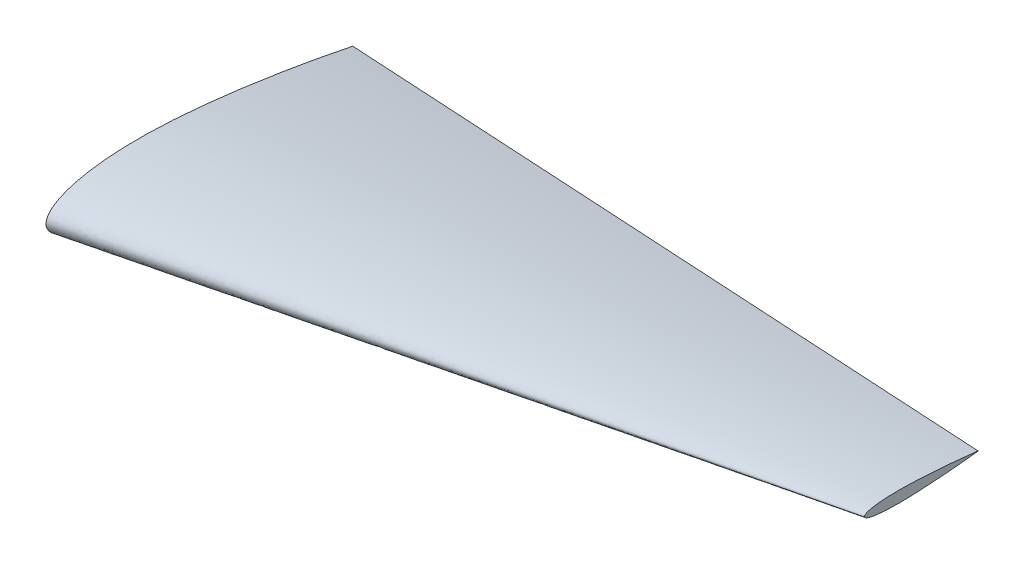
ISO-10303-21;
HEADER;
FILE_DESCRIPTION(('STEP AP214'),'2;1');
FILE_NAME('part.step','',(''),(''),'','','');
FILE_SCHEMA(('AUTOMOTIVE_DESIGN { 1 0 10303 214 1 1 1 1 }'));
ENDSEC;
DATA;
#1=APPLICATION_CONTEXT('core data for automotive mechanical design processes');
#2=APPLICATION_PROTOCOL_DEFINITION('international standard','automotive_design',2000,#1);
#3=PRODUCT_CONTEXT('',#1,'mechanical');
#4=PRODUCT('Part','Part','',(#3));
#5=PRODUCT_RELATED_PRODUCT_CATEGORY('part','',(#4));
#6=PRODUCT_DEFINITION_FORMATION('','',#4);
#7=PRODUCT_DEFINITION_CONTEXT('part definition',#1,'design');
#8=PRODUCT_DEFINITION('design','',#6,#7);
#9=PRODUCT_DEFINITION_SHAPE('','',#8);
#10=(LENGTH_UNIT() NAMED_UNIT(*) SI_UNIT(.MILLI.,.METRE.));
#11=(NAMED_UNIT(*) PLANE_ANGLE_UNIT() SI_UNIT($,.RADIAN.));
#12=(NAMED_UNIT(*) SI_UNIT($,.STERADIAN.) SOLID_ANGLE_UNIT());
#13=UNCERTAINTY_MEASURE_WITH_UNIT(LENGTH_MEASURE(1.E-05),#10,'distance_accuracy_value','');
#14=(GEOMETRIC_REPRESENTATION_CONTEXT(3) GLOBAL_UNCERTAINTY_ASSIGNED_CONTEXT((#13)) GLOBAL_UNIT_ASSIGNED_CONTEXT((#10,
#11,#12)) REPRESENTATION_CONTEXT('',''));
#15=CARTESIAN_POINT('',(0.,0.,0.));
#16=DIRECTION('',(0.,0.,1.));
#17=DIRECTION('',(1.,0.,0.));
#18=AXIS2_PLACEMENT_3D('',#15,#16,#17);
#19=CARTESIAN_POINT('',(14935.2,812.8,-2222.5));
#20=DIRECTION('',(-1.,0.,0.));
#21=DIRECTION('',(0.,0.,1.));
#22=AXIS2_PLACEMENT_3D('',#19,#20,#21);
#23=PLANE('',#22);
#24=CARTESIAN_POINT('',(14935.2,815.12029,-4432.3));
#25=CARTESIAN_POINT('',(14935.2,819.346363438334,-4395.47551523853));
#26=CARTESIAN_POINT('',(14935.2,827.795566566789,-4321.85219647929));
#27=CARTESIAN_POINT('',(14935.2,843.49566483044,-4174.56617552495));
#28=CARTESIAN_POINT('',(14935.2,861.540377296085,-3990.45543112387));
#29=CARTESIAN_POINT('',(14935.2,880.663705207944,-3769.46147230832));
#30=CARTESIAN_POINT('',(14935.2,897.345117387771,-3548.48591496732));
#31=CARTESIAN_POINT('',(14935.2,910.944822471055,-3327.50505017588));
#32=CARTESIAN_POINT('',(14935.2,920.621295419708,-3106.50973377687));
#33=CARTESIAN_POINT('',(14935.2,924.006009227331,-2922.27957229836));
#34=CARTESIAN_POINT('',(14935.2,922.66713878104,-2774.92190053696));
#35=CARTESIAN_POINT('',(14935.2,919.031186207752,-2664.37871481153));
#36=CARTESIAN_POINT('',(14935.2,912.014732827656,-2553.75681745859));
#37=CARTESIAN_POINT('',(14935.2,902.241566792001,-2461.64264259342));
#38=CARTESIAN_POINT('',(14935.2,890.524937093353,-2387.92899027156));
#39=CARTESIAN_POINT('',(14935.2,879.083851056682,-2332.52610242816));
#40=CARTESIAN_POINT('',(14935.2,864.547458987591,-2285.42062808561));
#41=CARTESIAN_POINT('',(14935.2,848.102286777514,-2246.35424727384));
#42=CARTESIAN_POINT('',(14935.2,812.8,-2208.37468663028));
#43=CARTESIAN_POINT('',(14935.2,777.497713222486,-2246.35424727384));
#44=CARTESIAN_POINT('',(14935.2,761.052541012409,-2285.42062808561));
#45=CARTESIAN_POINT('',(14935.2,746.516148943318,-2332.52610242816));
#46=CARTESIAN_POINT('',(14935.2,735.075062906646,-2387.92899027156));
#47=CARTESIAN_POINT('',(14935.2,723.358433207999,-2461.64264259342));
#48=CARTESIAN_POINT('',(14935.2,713.585267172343,-2553.75681745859));
#49=CARTESIAN_POINT('',(14935.2,706.568813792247,-2664.37871481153));
#50=CARTESIAN_POINT('',(14935.2,702.932861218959,-2774.92190053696));
#51=CARTESIAN_POINT('',(14935.2,701.593990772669,-2922.27957229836));
#52=CARTESIAN_POINT('',(14935.2,704.978704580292,-3106.50973377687));
#53=CARTESIAN_POINT('',(14935.2,714.655177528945,-3327.50505017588));
#54=CARTESIAN_POINT('',(14935.2,728.254882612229,-3548.48591496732));
#55=CARTESIAN_POINT('',(14935.2,744.936294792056,-3769.46147230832));
#56=CARTESIAN_POINT('',(14935.2,764.059622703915,-3990.45543112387));
#57=CARTESIAN_POINT('',(14935.2,782.104335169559,-4174.56617552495));
#58=CARTESIAN_POINT('',(14935.2,797.804433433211,-4321.85219647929));
#59=CARTESIAN_POINT('',(14935.2,806.253636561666,-4395.47551523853));
#60=CARTESIAN_POINT('',(14935.2,810.47971,-4432.3));
#61=B_SPLINE_CURVE_WITH_KNOTS('',3,(#24,#25,#26,#27,#28,#29,#30,#31,#32,#33,#34,#35,#36,#37,#38,
#39,#40,#41,#42,#43,#44,#45,#46,#47,#48,#49,#50,#51,#52,#53,#54,#55,#56,#57,#58,#59,#60),
.UNSPECIFIED.,.F.,.F.,(4,1,1,1,1,1,1,1,1,1,1,1,1,1,1,1,1,1,1,1,1,1,1,1,1,1,1,1,1,1,1,1,1,1,4),
(0.,0.0248235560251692,0.0496298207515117,0.0991970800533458,0.148712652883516,
0.198182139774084,0.247604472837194,0.296979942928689,0.34631759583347,0.370984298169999,
0.395664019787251,0.420382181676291,0.445198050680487,0.457689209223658,0.470304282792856,
0.483229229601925,0.4900691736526,0.5,0.5099308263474,0.516770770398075,0.529695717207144,
0.542310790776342,0.554801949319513,0.579617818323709,0.604335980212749,0.629015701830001,
0.65368240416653,0.703020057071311,0.752395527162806,0.801817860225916,0.851287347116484,
0.900802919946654,0.950370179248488,0.975176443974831,1.),.UNSPECIFIED.);
#62=CARTESIAN_POINT('',(14935.2,815.12029,-4432.3));
#63=VERTEX_POINT('',#62);
#64=CARTESIAN_POINT('',(14935.2,810.47971,-4432.3));
#65=VERTEX_POINT('',#64);
#66=EDGE_CURVE('E58',#63,#65,#61,.T.);
#67=ORIENTED_EDGE('',*,*,#66,.T.);
#68=DIRECTION('',(0.,1.,0.));
#69=VECTOR('',#68,1.);
#70=CARTESIAN_POINT('',(14935.2,815.12029,-4432.3));
#71=LINE('',#70,#69);
#72=EDGE_CURVE('E12',#65,#63,#71,.T.);
#73=ORIENTED_EDGE('',*,*,#72,.T.);
#74=EDGE_LOOP('',(#67,#73));
#75=FACE_BOUND('',#74,.T.);
#76=ADVANCED_FACE('F48',(#75),#23,.F.);
#77=CARTESIAN_POINT('',(1219.2,5.75685332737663E-10,1.09287578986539E-12));
#78=DIRECTION('',(-1.,0.,0.));
#79=DIRECTION('',(0.,0.,1.));
#80=AXIS2_PLACEMENT_3D('',#77,#78,#79);
#81=PLANE('',#80);
#82=CARTESIAN_POINT('',(1219.2,11.2910112,-5974.08));
#83=CARTESIAN_POINT('',(1219.2,31.8647324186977,-5874.56046449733));
#84=CARTESIAN_POINT('',(1219.2,72.9659085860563,-5675.74519343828));
#85=CARTESIAN_POINT('',(1219.2,149.222472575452,-5277.7494338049));
#86=CARTESIAN_POINT('',(1219.2,236.912546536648,-4780.23705300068));
#87=CARTESIAN_POINT('',(1219.2,330.257228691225,-4182.7518974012));
#88=CARTESIAN_POINT('',(1219.2,411.272923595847,-3585.35903312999));
#89=CARTESIAN_POINT('',(1219.2,477.533140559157,-2987.95799615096));
#90=CARTESIAN_POINT('',(1219.2,524.494664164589,-2390.41312173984));
#91=CARTESIAN_POINT('',(1219.2,541.175696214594,-1891.87330758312));
#92=CARTESIAN_POINT('',(1219.2,534.518135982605,-1493.27902018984));
#93=CARTESIAN_POINT('',(1219.2,516.801572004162,-1194.09128821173));
#94=CARTESIAN_POINT('',(1219.2,482.596469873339,-894.341071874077));
#95=CARTESIAN_POINT('',(1219.2,434.79814055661,-644.860533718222));
#96=CARTESIAN_POINT('',(1219.2,377.949357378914,-445.877300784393));
#97=CARTESIAN_POINT('',(1219.2,320.514983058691,-293.922685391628));
#98=CARTESIAN_POINT('',(1219.2,251.352347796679,-166.644400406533));
#99=CARTESIAN_POINT('',(1219.2,155.691980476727,-49.5670990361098));
#100=CARTESIAN_POINT('',(1219.2,5.78634039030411E-10,32.3453004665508));
#101=CARTESIAN_POINT('',(1219.2,-155.691980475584,-49.5670990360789));
#102=CARTESIAN_POINT('',(1219.2,-251.352347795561,-166.644400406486));
#103=CARTESIAN_POINT('',(1219.2,-320.514983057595,-293.922685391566));
#104=CARTESIAN_POINT('',(1219.2,-377.949357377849,-445.877300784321));
#105=CARTESIAN_POINT('',(1219.2,-434.798140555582,-644.860533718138));
#106=CARTESIAN_POINT('',(1219.2,-482.59646987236,-894.341071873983));
#107=CARTESIAN_POINT('',(1219.2,-516.801572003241,-1194.09128821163));
#108=CARTESIAN_POINT('',(1219.2,-534.518135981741,-1493.27902018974));
#109=CARTESIAN_POINT('',(1219.2,-541.175696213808,-1891.87330758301));
#110=CARTESIAN_POINT('',(1219.2,-524.494664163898,-2390.41312173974));
#111=CARTESIAN_POINT('',(1219.2,-477.533140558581,-2987.95799615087));
#112=CARTESIAN_POINT('',(1219.2,-411.272923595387,-3585.35903312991));
#113=CARTESIAN_POINT('',(1219.2,-330.257228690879,-4182.75189740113));
#114=CARTESIAN_POINT('',(1219.2,-236.912546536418,-4780.23705300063));
#115=CARTESIAN_POINT('',(1219.2,-149.222472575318,-5277.74943380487));
#116=CARTESIAN_POINT('',(1219.2,-72.9659085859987,-5675.74519343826));
#117=CARTESIAN_POINT('',(1219.2,-31.8647324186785,-5874.56046449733));
#118=CARTESIAN_POINT('',(1219.2,-11.2910112,-5974.08));
#119=B_SPLINE_CURVE_WITH_KNOTS('',3,(#82,#83,#84,#85,#86,#87,#88,#89,#90,#91,#92,#93,#94,#95,
#96,#97,#98,#99,#100,#101,#102,#103,#104,#105,#106,#107,#108,#109,#110,#111,#112,#113,#114,#115,
#116,#117,#118),.UNSPECIFIED.,.F.,.F.,(4,1,1,1,1,1,1,1,1,1,1,1,1,1,1,1,1,1,1,1,1,1,1,1,1,1,1,1,
1,1,1,1,1,1,4),(0.,0.0246038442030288,0.0491523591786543,0.0981086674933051,0.146905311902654,
0.195554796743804,0.244056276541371,0.292409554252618,0.340643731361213,0.364754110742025,
0.388905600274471,0.413178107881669,0.437756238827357,0.450304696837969,0.463229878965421,
0.477067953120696,0.485035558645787,0.5,0.514964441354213,0.522932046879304,0.536770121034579,
0.549695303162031,0.562243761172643,0.586821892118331,0.611094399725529,0.635245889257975,
0.659356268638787,0.707590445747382,0.755943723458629,0.804445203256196,0.853094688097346,
0.901891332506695,0.950847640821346,0.975396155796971,1.),.UNSPECIFIED.);
#120=CARTESIAN_POINT('',(1219.2,11.2910112,-5974.08));
#121=VERTEX_POINT('',#120);
#122=CARTESIAN_POINT('',(1219.2,-11.2910112,-5974.08));
#123=VERTEX_POINT('',#122);
#124=EDGE_CURVE('E82',#121,#123,#119,.T.);
#125=ORIENTED_EDGE('',*,*,#124,.F.);
#126=DIRECTION('',(0.,1.,0.));
#127=VECTOR('',#126,1.);
#128=CARTESIAN_POINT('',(1219.2,11.2910112,-5974.08));
#129=LINE('',#128,#127);
#130=EDGE_CURVE('E86',#123,#121,#129,.T.);
#131=ORIENTED_EDGE('',*,*,#130,.F.);
#132=EDGE_LOOP('',(#125,#131));
#133=FACE_BOUND('',#132,.T.);
#134=ADVANCED_FACE('F95',(#133),#81,.T.);
#135=CARTESIAN_POINT('',(1219.2,11.2910112,-5974.08));
#136=CARTESIAN_POINT('',(14935.2,815.12029,-4432.3));
#137=CARTESIAN_POINT('',(1219.2,31.8647324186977,-5874.56046449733));
#138=CARTESIAN_POINT('',(14935.2,819.308958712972,-4395.80144656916));
#139=CARTESIAN_POINT('',(1219.2,52.6221765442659,-5774.15222159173));
#140=CARTESIAN_POINT('',(14935.2,823.535032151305,-4358.97696180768));
#141=CARTESIAN_POINT('',(1219.2,92.2604228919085,-5575.04389670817));
#142=CARTESIAN_POINT('',(14935.2,831.611209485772,-4286.02946135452));
#143=CARTESIAN_POINT('',(1219.2,111.707763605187,-5473.5206036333));
#144=CARTESIAN_POINT('',(14935.2,835.574997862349,-4248.87166721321));
#145=CARTESIAN_POINT('',(1219.2,167.166081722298,-5175.94580537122));
#146=CARTESIAN_POINT('',(14935.2,846.871435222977,-4140.02782867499));
#147=CARTESIAN_POINT('',(1219.2,203.028703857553,-4972.36474288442));
#148=CARTESIAN_POINT('',(14935.2,854.169798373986,-4065.65766970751));
#149=CARTESIAN_POINT('',(1219.2,268.820543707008,-4575.99880167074));
#150=CARTESIAN_POINT('',(14935.2,867.532840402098,-3921.02309607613));
#151=CARTESIAN_POINT('',(1219.2,301.038498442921,-4369.47129648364));
#152=CARTESIAN_POINT('',(14935.2,874.06277430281,-3845.74348029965));
#153=CARTESIAN_POINT('',(1219.2,358.347562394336,-3975.61962594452));
#154=CARTESIAN_POINT('',(14935.2,885.708701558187,-3702.33514700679));
#155=CARTESIAN_POINT('',(1219.2,386.716268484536,-3765.72132380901));
#156=CARTESIAN_POINT('',(14935.2,891.494586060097,-3625.98681278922));
#157=CARTESIAN_POINT('',(1219.2,434.623539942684,-3374.83025645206));
#158=CARTESIAN_POINT('',(14935.2,901.277604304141,-3483.95695874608));
#159=CARTESIAN_POINT('',(1219.2,458.140133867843,-3161.11038082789));
#160=CARTESIAN_POINT('',(14935.2,906.090439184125,-3406.38365895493));
#161=CARTESIAN_POINT('',(1219.2,494.380270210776,-2773.59280526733));
#162=CARTESIAN_POINT('',(14935.2,913.578217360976,-3265.88272453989));
#163=CARTESIAN_POINT('',(1219.2,511.149702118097,-2555.60476811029));
#164=CARTESIAN_POINT('',(14935.2,917.099925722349,-3186.9322404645));
#165=CARTESIAN_POINT('',(1219.2,531.808974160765,-2171.81305339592));
#166=CARTESIAN_POINT('',(14935.2,921.577394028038,-3048.07500902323));
#167=CARTESIAN_POINT('',(1219.2,538.553684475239,-1949.14635833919));
#168=CARTESIAN_POINT('',(14935.2,923.173667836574,-2967.58396065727));
#169=CARTESIAN_POINT('',(1219.2,537.456413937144,-1669.19643837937));
#170=CARTESIAN_POINT('',(14935.2,923.393412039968,-2866.38265011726));
#171=CARTESIAN_POINT('',(1219.2,534.737987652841,-1543.89034112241));
#172=CARTESIAN_POINT('',(14935.2,923.086500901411,-2821.07739366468));
#173=CARTESIAN_POINT('',(1219.2,527.107434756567,-1368.1311136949));
#174=CARTESIAN_POINT('',(14935.2,921.943453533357,-2757.49503357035));
#175=CARTESIAN_POINT('',(1219.2,518.665670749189,-1240.70926248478));
#176=CARTESIAN_POINT('',(14935.2,920.5764234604,-2711.35827385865));
#177=CARTESIAN_POINT('',(1219.2,502.318753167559,-1067.17372887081));
#178=CARTESIAN_POINT('',(14935.2,917.809291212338,-2648.41267867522));
#179=CARTESIAN_POINT('',(1219.2,486.220726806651,-938.115711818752));
#180=CARTESIAN_POINT('',(14935.2,915.042021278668,-2601.48526004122));
#181=CARTESIAN_POINT('',(1219.2,458.092395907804,-766.443514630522));
#182=CARTESIAN_POINT('',(14935.2,910.124487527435,-2538.82472953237));
#183=CARTESIAN_POINT('',(1219.2,430.945269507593,-636.883111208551));
#184=CARTESIAN_POINT('',(14935.2,905.382358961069,-2491.24527883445));
#185=CARTESIAN_POINT('',(1219.2,398.429901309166,-517.563704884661));
#186=CARTESIAN_POINT('',(14935.2,899.592718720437,-2446.92602270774));
#187=CARTESIAN_POINT('',(1219.2,373.89634880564,-438.960762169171));
#188=CARTESIAN_POINT('',(14935.2,895.218804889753,-2417.45984920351));
#189=CARTESIAN_POINT('',(1219.2,348.827308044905,-368.828845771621));
#190=CARTESIAN_POINT('',(14935.2,890.744198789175,-2390.90714251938));
#191=CARTESIAN_POINT('',(1219.2,316.681095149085,-292.630276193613));
#192=CARTESIAN_POINT('',(14935.2,885.10034325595,-2361.66066548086));
#193=CARTESIAN_POINT('',(1219.2,280.688039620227,-220.630147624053));
#194=CARTESIAN_POINT('',(14935.2,878.647944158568,-2333.43860854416));
#195=CARTESIAN_POINT('',(1219.2,236.902419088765,-150.457235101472));
#196=CARTESIAN_POINT('',(14935.2,870.38411885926,-2304.33444318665));
#197=CARTESIAN_POINT('',(1219.2,199.322461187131,-102.965795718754));
#198=CARTESIAN_POINT('',(14935.2,863.242180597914,-2283.60559934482));
#199=CARTESIAN_POINT('',(1219.2,160.235452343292,-65.1413720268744));
#200=CARTESIAN_POINT('',(14935.2,856.389435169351,-2266.04080882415));
#201=CARTESIAN_POINT('',(1219.2,102.278435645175,-21.4652558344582));
#202=CARTESIAN_POINT('',(14935.2,845.714131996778,-2243.78497832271));
#203=CARTESIAN_POINT('',(1219.2,5.77666386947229E-10,14.2449506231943));
#204=CARTESIAN_POINT('',(14935.2,812.8,-2208.37468663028));
#205=CARTESIAN_POINT('',(1219.2,-102.278435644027,-21.4652558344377));
#206=CARTESIAN_POINT('',(14935.2,779.885868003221,-2243.78497832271));
#207=CARTESIAN_POINT('',(1219.2,-160.235452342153,-65.1413720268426));
#208=CARTESIAN_POINT('',(14935.2,769.210564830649,-2266.04080882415));
#209=CARTESIAN_POINT('',(1219.2,-199.322461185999,-102.965795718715));
#210=CARTESIAN_POINT('',(14935.2,762.357819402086,-2283.60559934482));
#211=CARTESIAN_POINT('',(1219.2,-236.902419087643,-150.457235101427));
#212=CARTESIAN_POINT('',(14935.2,755.21588114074,-2304.33444318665));
#213=CARTESIAN_POINT('',(1219.2,-280.688039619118,-220.630147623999));
#214=CARTESIAN_POINT('',(14935.2,746.952055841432,-2333.43860854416));
#215=CARTESIAN_POINT('',(1219.2,-316.68109514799,-292.630276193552));
#216=CARTESIAN_POINT('',(14935.2,740.49965674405,-2361.66066548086));
#217=CARTESIAN_POINT('',(1219.2,-348.827308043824,-368.828845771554));
#218=CARTESIAN_POINT('',(14935.2,734.855801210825,-2390.90714251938));
#219=CARTESIAN_POINT('',(1219.2,-373.896348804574,-438.960762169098));
#220=CARTESIAN_POINT('',(14935.2,730.381195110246,-2417.45984920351));
#221=CARTESIAN_POINT('',(1219.2,-398.429901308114,-517.563704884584));
#222=CARTESIAN_POINT('',(14935.2,726.007281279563,-2446.92602270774));
#223=CARTESIAN_POINT('',(1219.2,-430.945269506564,-636.883111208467));
#224=CARTESIAN_POINT('',(14935.2,720.217641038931,-2491.24527883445));
#225=CARTESIAN_POINT('',(1219.2,-458.0923959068,-766.443514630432));
#226=CARTESIAN_POINT('',(14935.2,715.475512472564,-2538.82472953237));
#227=CARTESIAN_POINT('',(1219.2,-486.22072680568,-938.115711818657));
#228=CARTESIAN_POINT('',(14935.2,710.557978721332,-2601.48526004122));
#229=CARTESIAN_POINT('',(1219.2,-502.318753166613,-1067.17372887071));
#230=CARTESIAN_POINT('',(14935.2,707.790708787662,-2648.41267867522));
#231=CARTESIAN_POINT('',(1219.2,-518.665670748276,-1240.70926248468));
#232=CARTESIAN_POINT('',(14935.2,705.0235765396,-2711.35827385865));
#233=CARTESIAN_POINT('',(1219.2,-527.107434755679,-1368.13111369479));
#234=CARTESIAN_POINT('',(14935.2,703.656546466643,-2757.49503357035));
#235=CARTESIAN_POINT('',(1219.2,-534.737987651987,-1543.8903411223));
#236=CARTESIAN_POINT('',(14935.2,702.513499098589,-2821.07739366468));
#237=CARTESIAN_POINT('',(1219.2,-537.456413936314,-1669.19643837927));
#238=CARTESIAN_POINT('',(14935.2,702.206587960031,-2866.38265011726));
#239=CARTESIAN_POINT('',(1219.2,-538.553684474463,-1949.14635833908));
#240=CARTESIAN_POINT('',(14935.2,702.426332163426,-2967.58396065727));
#241=CARTESIAN_POINT('',(1219.2,-531.808974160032,-2171.81305339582));
#242=CARTESIAN_POINT('',(14935.2,704.022605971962,-3048.07500902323));
#243=CARTESIAN_POINT('',(1219.2,-511.149702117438,-2555.60476811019));
#244=CARTESIAN_POINT('',(14935.2,708.500074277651,-3186.9322404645));
#245=CARTESIAN_POINT('',(1219.2,-494.380270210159,-2773.59280526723));
#246=CARTESIAN_POINT('',(14935.2,712.021782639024,-3265.88272453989));
#247=CARTESIAN_POINT('',(1219.2,-458.140133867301,-3161.11038082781));
#248=CARTESIAN_POINT('',(14935.2,719.509560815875,-3406.38365895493));
#249=CARTESIAN_POINT('',(1219.2,-434.623539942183,-3374.83025645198));
#250=CARTESIAN_POINT('',(14935.2,724.322395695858,-3483.95695874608));
#251=CARTESIAN_POINT('',(1219.2,-386.71626848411,-3765.72132380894));
#252=CARTESIAN_POINT('',(14935.2,734.105413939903,-3625.98681278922));
#253=CARTESIAN_POINT('',(1219.2,-358.34756239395,-3975.61962594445));
#254=CARTESIAN_POINT('',(14935.2,739.891298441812,-3702.33514700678));
#255=CARTESIAN_POINT('',(1219.2,-301.038498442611,-4369.47129648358));
#256=CARTESIAN_POINT('',(14935.2,751.537225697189,-3845.74348029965));
#257=CARTESIAN_POINT('',(1219.2,-268.820543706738,-4575.99880167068));
#258=CARTESIAN_POINT('',(14935.2,758.067159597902,-3921.02309607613));
#259=CARTESIAN_POINT('',(1219.2,-203.02870385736,-4972.36474288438));
#260=CARTESIAN_POINT('',(14935.2,771.430201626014,-4065.65766970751));
#261=CARTESIAN_POINT('',(1219.2,-167.166081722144,-5175.94580537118));
#262=CARTESIAN_POINT('',(14935.2,778.728564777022,-4140.02782867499));
#263=CARTESIAN_POINT('',(1219.2,-111.70776360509,-5473.52060363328));
#264=CARTESIAN_POINT('',(14935.2,790.025002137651,-4248.87166721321));
#265=CARTESIAN_POINT('',(1219.2,-92.2604228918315,-5575.04389670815));
#266=CARTESIAN_POINT('',(14935.2,793.988790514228,-4286.02946135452));
#267=CARTESIAN_POINT('',(1219.2,-52.6221765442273,-5774.15222159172));
#268=CARTESIAN_POINT('',(14935.2,802.064967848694,-4358.97696180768));
#269=CARTESIAN_POINT('',(1219.2,-31.8647324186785,-5874.56046449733));
#270=CARTESIAN_POINT('',(14935.2,806.291041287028,-4395.80144656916));
#271=CARTESIAN_POINT('',(1219.2,-11.2910112,-5974.08));
#272=CARTESIAN_POINT('',(14935.2,810.47971,-4432.3));
#273=B_SPLINE_SURFACE_WITH_KNOTS('',3,1,((#135,#136),(#137,#138),(#139,#140),(#141,#142),(#143,
#144),(#145,#146),(#147,#148),(#149,#150),(#151,#152),(#153,#154),(#155,#156),(#157,#158),(#159,
#160),(#161,#162),(#163,#164),(#165,#166),(#167,#168),(#169,#170),(#171,#172),(#173,#174),(#175,
#176),(#177,#178),(#179,#180),(#181,#182),(#183,#184),(#185,#186),(#187,#188),(#189,#190),(#191,
#192),(#193,#194),(#195,#196),(#197,#198),(#199,#200),(#201,#202),(#203,#204),(#205,#206),(#207,
#208),(#209,#210),(#211,#212),(#213,#214),(#215,#216),(#217,#218),(#219,#220),(#221,#222),(#223,
#224),(#225,#226),(#227,#228),(#229,#230),(#231,#232),(#233,#234),(#235,#236),(#237,#238),(#239,
#240),(#241,#242),(#243,#244),(#245,#246),(#247,#248),(#249,#250),(#251,#252),(#253,#254),(#255,
#256),(#257,#258),(#259,#260),(#261,#262),(#263,#264),(#265,#266),(#267,#268),(#269,#270),(#271,
#272)),.UNSPECIFIED.,.F.,.F.,.F.,(4,1,1,1,1,1,1,1,1,1,1,1,1,1,1,1,1,1,1,1,1,1,1,1,1,1,1,1,1,1,1,
1,1,1,1,1,1,1,1,1,1,1,1,1,1,1,1,1,1,1,1,1,1,1,1,1,1,1,1,1,1,1,1,1,1,1,4),(2,2),(0.,
0.0246038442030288,0.0248235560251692,0.0491523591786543,0.0496298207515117,0.0981086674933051,
0.0991970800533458,0.146905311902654,0.148712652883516,0.195554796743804,0.198182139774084,
0.244056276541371,0.247604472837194,0.292409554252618,0.296979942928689,0.340643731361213,
0.34631759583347,0.364754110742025,0.370984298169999,0.388905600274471,0.395664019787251,
0.413178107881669,0.420382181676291,0.437756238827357,0.445198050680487,0.450304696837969,
0.457689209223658,0.463229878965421,0.470304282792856,0.477067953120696,0.483229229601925,
0.485035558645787,0.4900691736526,0.5,0.5099308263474,0.514964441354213,0.516770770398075,
0.522932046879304,0.529695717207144,0.536770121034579,0.542310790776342,0.549695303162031,
0.554801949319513,0.562243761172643,0.579617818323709,0.586821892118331,0.604335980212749,
0.611094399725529,0.629015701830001,0.635245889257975,0.65368240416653,0.659356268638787,
0.703020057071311,0.707590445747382,0.752395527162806,0.755943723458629,0.801817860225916,
0.804445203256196,0.851287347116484,0.853094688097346,0.900802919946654,0.901891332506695,
0.950370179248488,0.950847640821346,0.975176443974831,0.975396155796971,1.),(0.,1.),.UNSPECIFIED.);
#274=DIRECTION('',(0.991984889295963,0.0594330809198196,0.111506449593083));
#275=VECTOR('',#274,1.);
#276=CARTESIAN_POINT('',(8077.2,399.5943494,-5203.19));
#277=LINE('',#276,#275);
#278=EDGE_CURVE('E66',#123,#65,#277,.T.);
#279=DIRECTION('',(-0.992060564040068,-0.0581399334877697,-0.111514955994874));
#280=VECTOR('',#279,1.);
#281=CARTESIAN_POINT('',(8077.2,413.2056506,-5203.19));
#282=LINE('',#281,#280);
#283=EDGE_CURVE('E78',#63,#121,#282,.T.);
#284=ORIENTED_EDGE('',*,*,#124,.T.);
#285=ORIENTED_EDGE('',*,*,#278,.T.);
#286=ORIENTED_EDGE('',*,*,#66,.F.);
#287=ORIENTED_EDGE('',*,*,#283,.T.);
#288=EDGE_LOOP('',(#284,#285,#286,#287));
#289=FACE_BOUND('',#288,.T.);
#290=ADVANCED_FACE('F80',(#289),#273,.T.);
#291=CARTESIAN_POINT('',(678.364530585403,0.,-6034.87391295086));
#292=DIRECTION('',(-0.111703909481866,0.,0.993741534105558));
#293=DIRECTION('',(0.993741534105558,0.,0.111703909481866));
#294=AXIS2_PLACEMENT_3D('',#291,#292,#293);
#295=PLANE('',#294);
#296=ORIENTED_EDGE('',*,*,#283,.F.);
#297=ORIENTED_EDGE('',*,*,#72,.F.);
#298=ORIENTED_EDGE('',*,*,#278,.F.);
#299=ORIENTED_EDGE('',*,*,#130,.T.);
#300=EDGE_LOOP('',(#296,#297,#298,#299));
#301=FACE_BOUND('',#300,.T.);
#302=ADVANCED_FACE('F89',(#301),#295,.F.);
#303=CLOSED_SHELL('',(#76,#134,#290,#302));
#304=MANIFOLD_SOLID_BREP('B2',#303);
#305=ADVANCED_BREP_SHAPE_REPRESENTATION('',(#18,#304),#14);
#306=SHAPE_DEFINITION_REPRESENTATION(#9,#305);
ENDSEC;
END-ISO-10303-21;
